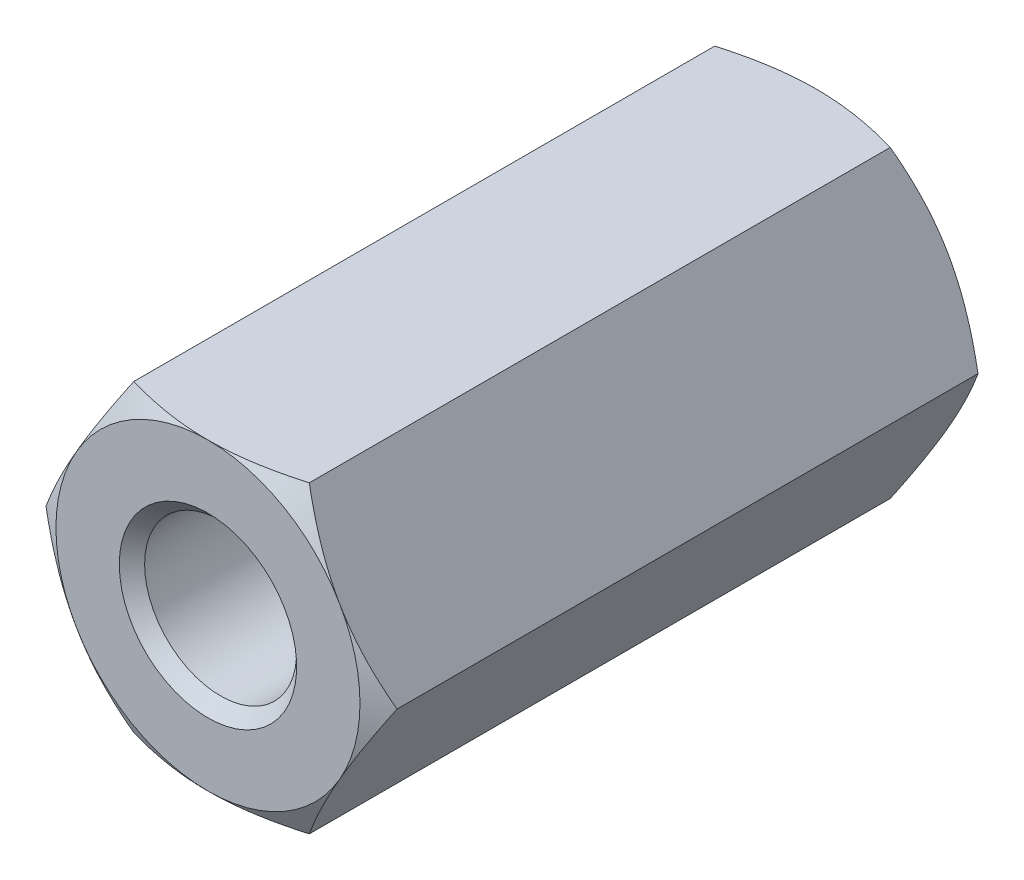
ISO-10303-21;
HEADER;
FILE_DESCRIPTION(('STEP AP214'),'2;1');
FILE_NAME('part.step','',(''),(''),'','','');
FILE_SCHEMA(('AUTOMOTIVE_DESIGN { 1 0 10303 214 1 1 1 1 }'));
ENDSEC;
DATA;
#1=APPLICATION_CONTEXT('core data for automotive mechanical design processes');
#2=APPLICATION_PROTOCOL_DEFINITION('international standard','automotive_design',2000,#1);
#3=PRODUCT_CONTEXT('',#1,'mechanical');
#4=PRODUCT('Part','Part','',(#3));
#5=PRODUCT_RELATED_PRODUCT_CATEGORY('part','',(#4));
#6=PRODUCT_DEFINITION_FORMATION('','',#4);
#7=PRODUCT_DEFINITION_CONTEXT('part definition',#1,'design');
#8=PRODUCT_DEFINITION('design','',#6,#7);
#9=PRODUCT_DEFINITION_SHAPE('','',#8);
#10=(LENGTH_UNIT() NAMED_UNIT(*) SI_UNIT(.MILLI.,.METRE.));
#11=(NAMED_UNIT(*) PLANE_ANGLE_UNIT() SI_UNIT($,.RADIAN.));
#12=(NAMED_UNIT(*) SI_UNIT($,.STERADIAN.) SOLID_ANGLE_UNIT());
#13=UNCERTAINTY_MEASURE_WITH_UNIT(LENGTH_MEASURE(1.E-05),#10,'distance_accuracy_value','');
#14=(GEOMETRIC_REPRESENTATION_CONTEXT(3) GLOBAL_UNCERTAINTY_ASSIGNED_CONTEXT((#13)) GLOBAL_UNIT_ASSIGNED_CONTEXT((#10,
#11,#12)) REPRESENTATION_CONTEXT('',''));
#15=CARTESIAN_POINT('',(0.,0.,0.));
#16=DIRECTION('',(0.,0.,1.));
#17=DIRECTION('',(1.,0.,0.));
#18=AXIS2_PLACEMENT_3D('',#15,#16,#17);
#19=CARTESIAN_POINT('',(3.46410161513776,0.,-6.));
#20=DIRECTION('',(0.866025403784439,0.5,0.));
#21=DIRECTION('',(-0.5,0.866025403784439,0.));
#22=AXIS2_PLACEMENT_3D('',#19,#20,#21);
#23=PLANE('',#22);
#24=CARTESIAN_POINT('',(3.46421708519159,-0.000199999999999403,5.73198413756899));
#25=CARTESIAN_POINT('',(3.38810199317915,0.131635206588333,5.77594629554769));
#26=CARTESIAN_POINT('',(3.31132988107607,0.26460840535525,5.81592841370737));
#27=CARTESIAN_POINT('',(3.15645624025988,0.532857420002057,5.88571791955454));
#28=CARTESIAN_POINT('',(3.078351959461,0.668138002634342,5.91550061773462));
#29=CARTESIAN_POINT('',(2.92311136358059,0.937022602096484,5.96186216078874));
#30=CARTESIAN_POINT('',(2.84599893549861,1.07058524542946,5.97874955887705));
#31=CARTESIAN_POINT('',(2.6914112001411,1.33833905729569,5.99891035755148));
#32=CARTESIAN_POINT('',(2.61393645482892,1.47252925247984,6.00220045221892));
#33=CARTESIAN_POINT('',(2.46916798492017,1.72327559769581,5.99535946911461));
#34=CARTESIAN_POINT('',(2.40185259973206,1.83986926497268,5.98690808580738));
#35=CARTESIAN_POINT('',(2.2676603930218,2.07229698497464,5.96012105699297));
#36=CARTESIAN_POINT('',(2.2007840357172,2.18813023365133,5.94177625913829));
#37=CARTESIAN_POINT('',(2.06631510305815,2.42103725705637,5.89591524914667));
#38=CARTESIAN_POINT('',(1.99873954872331,2.53808155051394,5.86820461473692));
#39=CARTESIAN_POINT('',(1.86459637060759,2.77042435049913,5.8053122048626));
#40=CARTESIAN_POINT('',(1.79802702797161,2.88572583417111,5.77014520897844));
#41=CARTESIAN_POINT('',(1.73193533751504,3.0002,5.73198413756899));
#42=B_SPLINE_CURVE_WITH_KNOTS('',3,(#24,#25,#26,#27,#28,#29,#30,#31,#32,#33,#34,#35,#36,#37,#38,
#39,#40,#41),.UNSPECIFIED.,.F.,.F.,(4,2,2,2,2,2,2,2,4),(0.,0.475539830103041,0.952222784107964,
1.41710776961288,1.88142182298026,2.28572436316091,2.69040156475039,3.10405572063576,
3.5168974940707),.UNSPECIFIED.);
#43=CARTESIAN_POINT('',(3.46410161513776,0.,5.73205080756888));
#44=VERTEX_POINT('',#43);
#45=CARTESIAN_POINT('',(2.59807621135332,1.5,6.));
#46=VERTEX_POINT('',#45);
#47=EDGE_CURVE('E127',#44,#46,#42,.T.);
#48=ORIENTED_EDGE('',*,*,#47,.F.);
#49=DIRECTION('',(0.,0.,1.));
#50=VECTOR('',#49,1.);
#51=CARTESIAN_POINT('',(3.46410161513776,0.,-6.));
#52=LINE('',#51,#50);
#53=CARTESIAN_POINT('',(3.46410161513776,0.,-5.73205080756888));
#54=VERTEX_POINT('',#53);
#55=EDGE_CURVE('E550',#54,#44,#52,.T.);
#56=ORIENTED_EDGE('',*,*,#55,.F.);
#57=CARTESIAN_POINT('',(3.46421708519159,-0.000199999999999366,-5.73198413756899));
#58=CARTESIAN_POINT('',(3.38810199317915,0.131635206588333,-5.77594629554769));
#59=CARTESIAN_POINT('',(3.31132988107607,0.26460840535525,-5.81592841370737));
#60=CARTESIAN_POINT('',(3.15645624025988,0.532857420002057,-5.88571791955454));
#61=CARTESIAN_POINT('',(3.078351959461,0.668138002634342,-5.91550061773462));
#62=CARTESIAN_POINT('',(2.92311136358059,0.937022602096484,-5.96186216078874));
#63=CARTESIAN_POINT('',(2.84599893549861,1.07058524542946,-5.97874955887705));
#64=CARTESIAN_POINT('',(2.6914112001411,1.33833905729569,-5.99891035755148));
#65=CARTESIAN_POINT('',(2.61393645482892,1.47252925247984,-6.00220045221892));
#66=CARTESIAN_POINT('',(2.46916798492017,1.72327559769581,-5.99535946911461));
#67=CARTESIAN_POINT('',(2.40185259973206,1.83986926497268,-5.98690808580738));
#68=CARTESIAN_POINT('',(2.2676603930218,2.07229698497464,-5.96012105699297));
#69=CARTESIAN_POINT('',(2.2007840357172,2.18813023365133,-5.94177625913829));
#70=CARTESIAN_POINT('',(2.06631510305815,2.42103725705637,-5.89591524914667));
#71=CARTESIAN_POINT('',(1.99873954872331,2.53808155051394,-5.86820461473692));
#72=CARTESIAN_POINT('',(1.86459637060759,2.77042435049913,-5.8053122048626));
#73=CARTESIAN_POINT('',(1.79802702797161,2.88572583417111,-5.77014520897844));
#74=CARTESIAN_POINT('',(1.73193533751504,3.0002,-5.73198413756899));
#75=B_SPLINE_CURVE_WITH_KNOTS('',3,(#57,#58,#59,#60,#61,#62,#63,#64,#65,#66,#67,#68,#69,#70,#71,
#72,#73,#74),.UNSPECIFIED.,.F.,.F.,(4,2,2,2,2,2,2,2,4),(0.,0.475539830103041,0.952222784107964,
1.41710776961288,1.88142182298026,2.28572436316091,2.69040156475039,3.10405572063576,
3.5168974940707),.UNSPECIFIED.);
#76=CARTESIAN_POINT('',(2.59807621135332,1.5,-6.));
#77=VERTEX_POINT('',#76);
#78=EDGE_CURVE('E582',#54,#77,#75,.T.);
#79=ORIENTED_EDGE('',*,*,#78,.T.);
#80=CARTESIAN_POINT('',(1.73205080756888,3.,-5.73205080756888));
#81=VERTEX_POINT('',#80);
#82=EDGE_CURVE('E269',#77,#81,#75,.T.);
#83=ORIENTED_EDGE('',*,*,#82,.T.);
#84=DIRECTION('',(0.,0.,1.));
#85=VECTOR('',#84,1.);
#86=CARTESIAN_POINT('',(1.73205080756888,3.,-6.));
#87=LINE('',#86,#85);
#88=CARTESIAN_POINT('',(1.73205080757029,3.,5.73205080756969));
#89=VERTEX_POINT('',#88);
#90=EDGE_CURVE('E159',#81,#89,#87,.T.);
#91=ORIENTED_EDGE('',*,*,#90,.T.);
#92=EDGE_CURVE('E140',#46,#89,#42,.T.);
#93=ORIENTED_EDGE('',*,*,#92,.F.);
#94=EDGE_LOOP('',(#48,#56,#79,#83,#91,#93));
#95=FACE_BOUND('',#94,.T.);
#96=ADVANCED_FACE('F41',(#95),#23,.T.);
#97=CARTESIAN_POINT('',(1.73205080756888,-3.,-6.));
#98=DIRECTION('',(0.866025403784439,-0.5,0.));
#99=DIRECTION('',(0.5,0.866025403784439,0.));
#100=AXIS2_PLACEMENT_3D('',#97,#98,#99);
#101=PLANE('',#100);
#102=CARTESIAN_POINT('',(1.73193533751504,-3.0002,5.73198413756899));
#103=CARTESIAN_POINT('',(1.80805042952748,-2.86836479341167,5.77594629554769));
#104=CARTESIAN_POINT('',(1.88482254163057,-2.73539159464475,5.81592841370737));
#105=CARTESIAN_POINT('',(2.03969618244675,-2.46714257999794,5.88571791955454));
#106=CARTESIAN_POINT('',(2.11780046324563,-2.33186199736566,5.91550061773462));
#107=CARTESIAN_POINT('',(2.27304105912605,-2.06297739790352,5.96186216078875));
#108=CARTESIAN_POINT('',(2.35015348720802,-1.92941475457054,5.97874955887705));
#109=CARTESIAN_POINT('',(2.50474122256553,-1.66166094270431,5.99891035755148));
#110=CARTESIAN_POINT('',(2.58221596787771,-1.52747074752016,6.00220045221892));
#111=CARTESIAN_POINT('',(2.72698443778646,-1.27672440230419,5.99535946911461));
#112=CARTESIAN_POINT('',(2.79429982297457,-1.16013073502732,5.98690808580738));
#113=CARTESIAN_POINT('',(2.92849202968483,-0.927703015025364,5.96012105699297));
#114=CARTESIAN_POINT('',(2.99536838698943,-0.811869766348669,5.94177625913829));
#115=CARTESIAN_POINT('',(3.12983731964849,-0.578962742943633,5.89591524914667));
#116=CARTESIAN_POINT('',(3.19741287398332,-0.461918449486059,5.86820461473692));
#117=CARTESIAN_POINT('',(3.33155605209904,-0.229575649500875,5.8053122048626));
#118=CARTESIAN_POINT('',(3.39812539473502,-0.114274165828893,5.77014520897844));
#119=CARTESIAN_POINT('',(3.46421708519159,0.000200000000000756,5.73198413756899));
#120=B_SPLINE_CURVE_WITH_KNOTS('',3,(#102,#103,#104,#105,#106,#107,#108,#109,#110,#111,#112,
#113,#114,#115,#116,#117,#118,#119),.UNSPECIFIED.,.F.,.F.,(4,2,2,2,2,2,2,2,4),(0.,
0.475539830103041,0.952222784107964,1.41710776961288,1.88142182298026,2.28572436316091,
2.69040156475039,3.10405572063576,3.5168974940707),.UNSPECIFIED.);
#121=CARTESIAN_POINT('',(1.73205080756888,-3.,5.73205080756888));
#122=VERTEX_POINT('',#121);
#123=CARTESIAN_POINT('',(2.59807621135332,-1.5,6.));
#124=VERTEX_POINT('',#123);
#125=EDGE_CURVE('E537',#122,#124,#120,.T.);
#126=ORIENTED_EDGE('',*,*,#125,.F.);
#127=DIRECTION('',(0.,0.,1.));
#128=VECTOR('',#127,1.);
#129=CARTESIAN_POINT('',(1.73205080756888,-3.,-6.));
#130=LINE('',#129,#128);
#131=CARTESIAN_POINT('',(1.73205080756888,-3.,-5.73205080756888));
#132=VERTEX_POINT('',#131);
#133=EDGE_CURVE('E283',#132,#122,#130,.T.);
#134=ORIENTED_EDGE('',*,*,#133,.F.);
#135=CARTESIAN_POINT('',(1.73193533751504,-3.0002,-5.73198413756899));
#136=CARTESIAN_POINT('',(1.80805042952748,-2.86836479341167,-5.77594629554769));
#137=CARTESIAN_POINT('',(1.88482254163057,-2.73539159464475,-5.81592841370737));
#138=CARTESIAN_POINT('',(2.03969618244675,-2.46714257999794,-5.88571791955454));
#139=CARTESIAN_POINT('',(2.11780046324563,-2.33186199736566,-5.91550061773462));
#140=CARTESIAN_POINT('',(2.27304105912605,-2.06297739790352,-5.96186216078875));
#141=CARTESIAN_POINT('',(2.35015348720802,-1.92941475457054,-5.97874955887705));
#142=CARTESIAN_POINT('',(2.50474122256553,-1.66166094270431,-5.99891035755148));
#143=CARTESIAN_POINT('',(2.58221596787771,-1.52747074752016,-6.00220045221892));
#144=CARTESIAN_POINT('',(2.72698443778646,-1.27672440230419,-5.99535946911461));
#145=CARTESIAN_POINT('',(2.79429982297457,-1.16013073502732,-5.98690808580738));
#146=CARTESIAN_POINT('',(2.92849202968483,-0.927703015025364,-5.96012105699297));
#147=CARTESIAN_POINT('',(2.99536838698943,-0.811869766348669,-5.94177625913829));
#148=CARTESIAN_POINT('',(3.12983731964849,-0.578962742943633,-5.89591524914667));
#149=CARTESIAN_POINT('',(3.19741287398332,-0.461918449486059,-5.86820461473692));
#150=CARTESIAN_POINT('',(3.33155605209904,-0.229575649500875,-5.8053122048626));
#151=CARTESIAN_POINT('',(3.39812539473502,-0.114274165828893,-5.77014520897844));
#152=CARTESIAN_POINT('',(3.46421708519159,0.000200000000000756,-5.73198413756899));
#153=B_SPLINE_CURVE_WITH_KNOTS('',3,(#135,#136,#137,#138,#139,#140,#141,#142,#143,#144,#145,
#146,#147,#148,#149,#150,#151,#152),.UNSPECIFIED.,.F.,.F.,(4,2,2,2,2,2,2,2,4),(0.,
0.475539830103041,0.952222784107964,1.41710776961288,1.88142182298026,2.28572436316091,
2.69040156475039,3.10405572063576,3.5168974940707),.UNSPECIFIED.);
#154=CARTESIAN_POINT('',(2.59807621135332,-1.5,-6.));
#155=VERTEX_POINT('',#154);
#156=EDGE_CURVE('E539',#132,#155,#153,.T.);
#157=ORIENTED_EDGE('',*,*,#156,.T.);
#158=EDGE_CURVE('E284',#155,#54,#153,.T.);
#159=ORIENTED_EDGE('',*,*,#158,.T.);
#160=ORIENTED_EDGE('',*,*,#55,.T.);
#161=EDGE_CURVE('E132',#124,#44,#120,.T.);
#162=ORIENTED_EDGE('',*,*,#161,.F.);
#163=EDGE_LOOP('',(#126,#134,#157,#159,#160,#162));
#164=FACE_BOUND('',#163,.T.);
#165=ADVANCED_FACE('F254',(#164),#101,.T.);
#166=CARTESIAN_POINT('',(-1.73205080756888,-3.,-6.));
#167=DIRECTION('',(0.,-1.,0.));
#168=DIRECTION('',(0.,0.,-1.));
#169=AXIS2_PLACEMENT_3D('',#166,#167,#168);
#170=PLANE('',#169);
#171=CARTESIAN_POINT('',(-11.3900038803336,-3.,0.93175207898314));
#172=CARTESIAN_POINT('',(-11.1402212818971,-3.,1.07120117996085));
#173=CARTESIAN_POINT('',(-10.8903172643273,-3.,1.21043343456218));
#174=CARTESIAN_POINT('',(-10.3901999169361,-3.,1.48834521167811));
#175=CARTESIAN_POINT('',(-10.1399865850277,-3.,1.62702473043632));
#176=CARTESIAN_POINT('',(-9.6391117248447,-3.,1.90375197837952));
#177=CARTESIAN_POINT('',(-9.38845008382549,-3.,2.04179950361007));
#178=CARTESIAN_POINT('',(-8.88666465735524,-3.,2.31705081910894));
#179=CARTESIAN_POINT('',(-8.6355408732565,-3.,2.45425461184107));
#180=CARTESIAN_POINT('',(-8.13250076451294,-3.,2.72770681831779));
#181=CARTESIAN_POINT('',(-7.88058395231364,-3.,2.86395433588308));
#182=CARTESIAN_POINT('',(-7.37600512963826,-3.,3.13506213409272));
#183=CARTESIAN_POINT('',(-7.12334312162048,-3.,3.26992241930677));
#184=CARTESIAN_POINT('',(-6.61708332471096,-3.,3.53778812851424));
#185=CARTESIAN_POINT('',(-6.36348567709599,-3.,3.67079381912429));
#186=CARTESIAN_POINT('',(-5.85500039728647,-3.,3.93431290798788));
#187=CARTESIAN_POINT('',(-5.60011278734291,-3.,4.06482634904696));
#188=CARTESIAN_POINT('',(-5.08914922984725,-3.,4.32207425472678));
#189=CARTESIAN_POINT('',(-4.8330772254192,-3.,4.44881653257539));
#190=CARTESIAN_POINT('',(-4.31844029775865,-3.,4.69731407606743));
#191=CARTESIAN_POINT('',(-4.05987490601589,-3.,4.8190683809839));
#192=CARTESIAN_POINT('',(-3.6688974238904,-3.,4.99621890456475));
#193=CARTESIAN_POINT('',(-3.53777997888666,-3.,5.05446851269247));
#194=CARTESIAN_POINT('',(-3.2744965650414,-3.,5.16854187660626));
#195=CARTESIAN_POINT('',(-3.14233063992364,-3.,5.22436573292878));
#196=CARTESIAN_POINT('',(-2.8767675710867,-3.,5.33295339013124));
#197=CARTESIAN_POINT('',(-2.74337064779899,-3.,5.38571772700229));
#198=CARTESIAN_POINT('',(-2.47511113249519,-3.,5.48735814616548));
#199=CARTESIAN_POINT('',(-2.34024866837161,-3.,5.536234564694));
#200=CARTESIAN_POINT('',(-2.0327436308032,-3.,5.64136869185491));
#201=CARTESIAN_POINT('',(-1.85958271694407,-3.,5.69613764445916));
#202=CARTESIAN_POINT('',(-1.510173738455,-3.,5.79491901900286));
#203=CARTESIAN_POINT('',(-1.33392584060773,-3.,5.83893202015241));
#204=CARTESIAN_POINT('',(-0.980278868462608,-3.,5.91232983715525));
#205=CARTESIAN_POINT('',(-0.802913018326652,-3.,5.94186814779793));
#206=CARTESIAN_POINT('',(-0.535401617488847,-3.,5.97335847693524));
#207=CARTESIAN_POINT('',(-0.445990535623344,-3.,5.98171899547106));
#208=CARTESIAN_POINT('',(-0.266865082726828,-3.,5.99391766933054));
#209=CARTESIAN_POINT('',(-0.177150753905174,-3.,5.99775642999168));
#210=CARTESIAN_POINT('',(0.00315277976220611,-3.,6.00078728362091));
#211=CARTESIAN_POINT('',(0.0937426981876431,-3.,5.9999379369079));
#212=CARTESIAN_POINT('',(0.274747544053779,-3.,5.99353525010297));
#213=CARTESIAN_POINT('',(0.365162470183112,-3.,5.98798187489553));
#214=CARTESIAN_POINT('',(0.635856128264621,-3.,5.96451076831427));
#215=CARTESIAN_POINT('',(0.815582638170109,-3.,5.93978204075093));
#216=CARTESIAN_POINT('',(1.08396675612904,-3.,5.89107357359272));
#217=CARTESIAN_POINT('',(1.1737345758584,-3.,5.87276348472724));
#218=CARTESIAN_POINT('',(1.35250903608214,-3.,5.83270775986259));
#219=CARTESIAN_POINT('',(1.44151566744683,-3.,5.81096208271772));
#220=CARTESIAN_POINT('',(1.61874099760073,-3.,5.76447348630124));
#221=CARTESIAN_POINT('',(1.70695964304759,-3.,5.7397303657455));
#222=CARTESIAN_POINT('',(1.88262194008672,-3.,5.6876607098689));
#223=CARTESIAN_POINT('',(1.97006563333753,-3.,5.66033431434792));
#224=CARTESIAN_POINT('',(2.23040210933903,-3.,5.57533875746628));
#225=CARTESIAN_POINT('',(2.40222853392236,-3.,5.51440131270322));
#226=CARTESIAN_POINT('',(2.74349273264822,-3.,5.38613271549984));
#227=CARTESIAN_POINT('',(2.91292981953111,-3.,5.31879976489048));
#228=CARTESIAN_POINT('',(3.25000717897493,-3.,5.17935808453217));
#229=CARTESIAN_POINT('',(3.41764556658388,-3.,5.10724482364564));
#230=CARTESIAN_POINT('',(3.75133609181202,-3.,4.95950256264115));
#231=CARTESIAN_POINT('',(3.91738839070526,-3.,4.88387392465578));
#232=CARTESIAN_POINT('',(4.24868931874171,-3.,4.72973411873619));
#233=CARTESIAN_POINT('',(4.41393458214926,-3.,4.65121574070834));
#234=CARTESIAN_POINT('',(4.74342076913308,-3.,4.49209591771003));
#235=CARTESIAN_POINT('',(4.90766167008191,-3.,4.411494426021));
#236=CARTESIAN_POINT('',(5.39899797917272,-3.,4.16735519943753));
#237=CARTESIAN_POINT('',(5.7248891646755,-3.,4.00139663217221));
#238=CARTESIAN_POINT('',(6.37494052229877,-3.,3.66514384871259));
#239=CARTESIAN_POINT('',(6.69909795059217,-3.,3.49484436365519));
#240=CARTESIAN_POINT('',(7.34595489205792,-3.,3.15140586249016));
#241=CARTESIAN_POINT('',(7.66865421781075,-3.,2.97826649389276));
#242=CARTESIAN_POINT('',(8.31253728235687,-3.,2.63023634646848));
#243=CARTESIAN_POINT('',(8.63372248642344,-3.,2.455348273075));
#244=CARTESIAN_POINT('',(9.27529852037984,-3.,2.10412078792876));
#245=CARTESIAN_POINT('',(9.5956893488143,-3.,1.92778137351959));
#246=CARTESIAN_POINT('',(10.0388880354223,-3.,1.68286313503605));
#247=CARTESIAN_POINT('',(10.1619534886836,-3.,1.61474979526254));
#248=CARTESIAN_POINT('',(10.4080246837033,-3.,1.47836422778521));
#249=CARTESIAN_POINT('',(10.5310304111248,-3.,1.41009197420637));
#250=CARTESIAN_POINT('',(10.776746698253,-3.,1.27353800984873));
#251=CARTESIAN_POINT('',(10.8994573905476,-3.,1.20525653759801));
#252=CARTESIAN_POINT('',(11.1447900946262,-3.,1.06858544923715));
#253=CARTESIAN_POINT('',(11.267412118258,-3.,1.00019585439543));
#254=CARTESIAN_POINT('',(11.3900038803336,-3.,0.931752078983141));
#255=B_SPLINE_CURVE_WITH_KNOTS('',3,(#171,#172,#173,#174,#175,#176,#177,#178,#179,#180,#181,
#182,#183,#184,#185,#186,#187,#188,#189,#190,#191,#192,#193,#194,#195,#196,#197,#198,#199,#200,
#201,#202,#203,#204,#205,#206,#207,#208,#209,#210,#211,#212,#213,#214,#215,#216,#217,#218,#219,
#220,#221,#222,#223,#224,#225,#226,#227,#228,#229,#230,#231,#232,#233,#234,#235,#236,#237,#238,
#239,#240,#241,#242,#243,#244,#245,#246,#247,#248,#249,#250,#251,#252,#253,#254),.UNSPECIFIED.,
.F.,.F.,(4,2,2,2,2,2,2,2,2,2,2,2,2,2,2,2,2,2,2,2,2,2,2,2,2,2,2,2,2,2,2,2,2,2,2,2,2,2,2,2,2,4),
(0.,0.858217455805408,1.71644073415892,2.57492380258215,3.43340436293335,4.29260376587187,
5.15180033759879,6.01087209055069,6.8699290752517,7.72706091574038,8.58435707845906,
9.01476061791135,9.44514630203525,9.87545635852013,10.3057291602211,10.8503129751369,
11.3948674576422,11.9335151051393,12.2028200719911,12.4720889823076,12.7437418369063,
13.0153967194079,13.5587097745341,13.8335126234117,14.1083187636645,14.3831433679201,
14.6579531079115,15.2046908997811,15.7515828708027,16.2990008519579,16.8463625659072,
17.3951974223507,17.9440445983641,19.041134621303,20.1396264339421,21.2382556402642,
22.3353890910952,23.4325245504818,23.854497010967,24.2765438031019,24.697830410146,
25.1190424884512),.UNSPECIFIED.);
#256=CARTESIAN_POINT('',(-1.73205080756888,-3.,5.73205080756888));
#257=VERTEX_POINT('',#256);
#258=CARTESIAN_POINT('',(0.,-3.,6.));
#259=VERTEX_POINT('',#258);
#260=EDGE_CURVE('E558',#257,#259,#255,.T.);
#261=ORIENTED_EDGE('',*,*,#260,.F.);
#262=DIRECTION('',(0.,0.,1.));
#263=VECTOR('',#262,1.);
#264=CARTESIAN_POINT('',(-1.73205080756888,-3.,-6.));
#265=LINE('',#264,#263);
#266=CARTESIAN_POINT('',(-1.73205080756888,-3.,-5.73205080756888));
#267=VERTEX_POINT('',#266);
#268=EDGE_CURVE('E535',#267,#257,#265,.T.);
#269=ORIENTED_EDGE('',*,*,#268,.F.);
#270=CARTESIAN_POINT('',(-7.74548365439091,-3.,-2.93647934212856));
#271=CARTESIAN_POINT('',(-7.57146996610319,-3.,-3.03015587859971));
#272=CARTESIAN_POINT('',(-7.3972904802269,-3.,-3.12352618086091));
#273=CARTESIAN_POINT('',(-7.0485144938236,-3.,-3.30949426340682));
#274=CARTESIAN_POINT('',(-6.87391798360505,-3.,-3.40209202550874));
#275=CARTESIAN_POINT('',(-6.52407229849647,-3.,-3.58643402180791));
#276=CARTESIAN_POINT('',(-6.34882267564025,-3.,-3.67817740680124));
#277=CARTESIAN_POINT('',(-5.99771962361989,-3.,-3.86049873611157));
#278=CARTESIAN_POINT('',(-5.82186619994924,-3.,-3.95107669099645));
#279=CARTESIAN_POINT('',(-5.46231182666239,-3.,-4.13439221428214));
#280=CARTESIAN_POINT('',(-5.27858020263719,-3.,-4.22706972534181));
#281=CARTESIAN_POINT('',(-4.91010340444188,-3.,-4.41038621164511));
#282=CARTESIAN_POINT('',(-4.72535824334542,-3.,-4.50102521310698));
#283=CARTESIAN_POINT('',(-4.35463989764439,-3.,-4.67959630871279));
#284=CARTESIAN_POINT('',(-4.16866716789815,-3.,-4.76752934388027));
#285=CARTESIAN_POINT('',(-3.79507118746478,-3.,-4.93980441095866));
#286=CARTESIAN_POINT('',(-3.60744803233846,-3.,-5.02414664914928));
#287=CARTESIAN_POINT('',(-3.21921577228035,-3.,-5.19262921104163));
#288=CARTESIAN_POINT('',(-3.0184798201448,-3.,-5.27647962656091));
#289=CARTESIAN_POINT('',(-2.61381768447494,-3.,-5.43638442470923));
#290=CARTESIAN_POINT('',(-2.40989060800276,-3.,-5.51243657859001));
#291=CARTESIAN_POINT('',(-2.00053042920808,-3.,-5.65237011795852));
#292=CARTESIAN_POINT('',(-1.79514384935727,-3.,-5.71638511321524));
#293=CARTESIAN_POINT('',(-1.38002064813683,-3.,-5.8284619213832));
#294=CARTESIAN_POINT('',(-1.17028662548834,-3.,-5.87653298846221));
#295=CARTESIAN_POINT('',(-0.794006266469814,-3.,-5.94264508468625));
#296=CARTESIAN_POINT('',(-0.628232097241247,-3.,-5.96498768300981));
#297=CARTESIAN_POINT('',(-0.295337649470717,-3.,-5.99421350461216));
#298=CARTESIAN_POINT('',(-0.128217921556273,-3.,-6.00110275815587));
#299=CARTESIAN_POINT('',(0.206103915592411,-3.,-5.99860539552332));
#300=CARTESIAN_POINT('',(0.373305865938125,-3.,-5.98919838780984));
#301=CARTESIAN_POINT('',(0.706141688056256,-3.,-5.95518699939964));
#302=CARTESIAN_POINT('',(0.871775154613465,-3.,-5.93057879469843));
#303=CARTESIAN_POINT('',(1.2182340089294,-3.,-5.86528769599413));
#304=CARTESIAN_POINT('',(1.39878062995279,-3.,-5.82316231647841));
#305=CARTESIAN_POINT('',(1.75671584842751,-3.,-5.72698316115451));
#306=CARTESIAN_POINT('',(1.93410214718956,-3.,-5.67292105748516));
#307=CARTESIAN_POINT('',(2.28638755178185,-3.,-5.55591066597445));
#308=CARTESIAN_POINT('',(2.46127894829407,-3.,-5.49293952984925));
#309=CARTESIAN_POINT('',(2.80855860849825,-3.,-5.36062387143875));
#310=CARTESIAN_POINT('',(2.98094745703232,-3.,-5.29128086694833));
#311=CARTESIAN_POINT('',(3.32628458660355,-3.,-5.14684908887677));
#312=CARTESIAN_POINT('',(3.49920347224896,-3.,-5.07169053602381));
#313=CARTESIAN_POINT('',(3.84343885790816,-3.,-4.91779095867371));
#314=CARTESIAN_POINT('',(4.01475529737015,-3.,-4.83904979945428));
#315=CARTESIAN_POINT('',(4.35585639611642,-3.,-4.67898476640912));
#316=CARTESIAN_POINT('',(4.52564298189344,-3.,-4.597664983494));
#317=CARTESIAN_POINT('',(4.86420703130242,-3.,-4.43294915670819));
#318=CARTESIAN_POINT('',(5.03298447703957,-3.,-4.34955307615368));
#319=CARTESIAN_POINT('',(5.4174896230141,-3.,-4.15725429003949));
#320=CARTESIAN_POINT('',(5.63295451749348,-3.,-4.04782684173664));
#321=CARTESIAN_POINT('',(6.06286115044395,-3.,-3.82698178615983));
#322=CARTESIAN_POINT('',(6.27730288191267,-3.,-3.71556416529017));
#323=CARTESIAN_POINT('',(6.70107258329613,-3.,-3.4934738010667));
#324=CARTESIAN_POINT('',(6.91041645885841,-3.,-3.38283135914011));
#325=CARTESIAN_POINT('',(7.32841241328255,-3.,-3.16042860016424));
#326=CARTESIAN_POINT('',(7.53706471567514,-3.,-3.04866870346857));
#327=CARTESIAN_POINT('',(7.74548365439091,-3.,-2.93647934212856));
#328=B_SPLINE_CURVE_WITH_KNOTS('',3,(#270,#271,#272,#273,#274,#275,#276,#277,#278,#279,#280,
#281,#282,#283,#284,#285,#286,#287,#288,#289,#290,#291,#292,#293,#294,#295,#296,#297,#298,#299,
#300,#301,#302,#303,#304,#305,#306,#307,#308,#309,#310,#311,#312,#313,#314,#315,#316,#317,#318,
#319,#320,#321,#322,#323,#324,#325,#326,#327),.UNSPECIFIED.,.F.,.F.,(4,2,2,2,2,2,2,2,2,2,2,2,2,
2,2,2,2,2,2,2,2,2,2,2,2,2,2,2,4),(0.,0.592879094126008,1.18577210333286,1.77920221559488,
2.37262694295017,2.98996472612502,3.6072945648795,4.22440723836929,4.8414844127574,
5.4940087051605,6.14671897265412,6.79169049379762,7.43628700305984,7.93748287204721,
8.43848312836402,8.94011073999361,9.44186459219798,9.99750279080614,10.5535298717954,
11.1110097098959,11.6683570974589,12.2339427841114,12.7995497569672,13.3643003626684,
13.9290609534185,14.6540258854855,15.3789957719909,16.0893434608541,16.7994333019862),.UNSPECIFIED.);
#329=CARTESIAN_POINT('',(0.,-3.,-6.));
#330=VERTEX_POINT('',#329);
#331=EDGE_CURVE('E547',#267,#330,#328,.T.);
#332=ORIENTED_EDGE('',*,*,#331,.T.);
#333=EDGE_CURVE('E259',#330,#132,#328,.T.);
#334=ORIENTED_EDGE('',*,*,#333,.T.);
#335=ORIENTED_EDGE('',*,*,#133,.T.);
#336=EDGE_CURVE('E138',#259,#122,#255,.T.);
#337=ORIENTED_EDGE('',*,*,#336,.F.);
#338=EDGE_LOOP('',(#261,#269,#332,#334,#335,#337));
#339=FACE_BOUND('',#338,.T.);
#340=ADVANCED_FACE('F292',(#339),#170,.T.);
#341=CARTESIAN_POINT('',(-3.46410161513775,0.,-6.));
#342=DIRECTION('',(-0.866025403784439,-0.5,0.));
#343=DIRECTION('',(0.5,-0.866025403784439,0.));
#344=AXIS2_PLACEMENT_3D('',#341,#342,#343);
#345=PLANE('',#344);
#346=CARTESIAN_POINT('',(-3.46421708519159,0.000200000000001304,5.73198413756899));
#347=CARTESIAN_POINT('',(-3.38810199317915,-0.131635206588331,5.77594629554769));
#348=CARTESIAN_POINT('',(-3.31132988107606,-0.264608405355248,5.81592841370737));
#349=CARTESIAN_POINT('',(-3.15645624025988,-0.532857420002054,5.88571791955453));
#350=CARTESIAN_POINT('',(-3.078351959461,-0.66813800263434,5.91550061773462));
#351=CARTESIAN_POINT('',(-2.92311136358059,-0.937022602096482,5.96186216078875));
#352=CARTESIAN_POINT('',(-2.84599893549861,-1.07058524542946,5.97874955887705));
#353=CARTESIAN_POINT('',(-2.6914112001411,-1.33833905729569,5.99891035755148));
#354=CARTESIAN_POINT('',(-2.61393645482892,-1.47252925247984,6.00220045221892));
#355=CARTESIAN_POINT('',(-2.46916798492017,-1.72327559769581,5.99535946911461));
#356=CARTESIAN_POINT('',(-2.40185259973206,-1.83986926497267,5.98690808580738));
#357=CARTESIAN_POINT('',(-2.2676603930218,-2.07229698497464,5.96012105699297));
#358=CARTESIAN_POINT('',(-2.2007840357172,-2.18813023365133,5.94177625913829));
#359=CARTESIAN_POINT('',(-2.06631510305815,-2.42103725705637,5.89591524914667));
#360=CARTESIAN_POINT('',(-1.99873954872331,-2.53808155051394,5.86820461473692));
#361=CARTESIAN_POINT('',(-1.86459637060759,-2.77042435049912,5.8053122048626));
#362=CARTESIAN_POINT('',(-1.79802702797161,-2.88572583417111,5.77014520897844));
#363=CARTESIAN_POINT('',(-1.73193533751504,-3.0002,5.73198413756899));
#364=B_SPLINE_CURVE_WITH_KNOTS('',3,(#346,#347,#348,#349,#350,#351,#352,#353,#354,#355,#356,
#357,#358,#359,#360,#361,#362,#363),.UNSPECIFIED.,.F.,.F.,(4,2,2,2,2,2,2,2,4),(0.,
0.47553983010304,0.952222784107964,1.41710776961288,1.88142182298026,2.28572436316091,
2.69040156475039,3.10405572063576,3.5168974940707),.UNSPECIFIED.);
#365=CARTESIAN_POINT('',(-3.46410161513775,0.,5.73205080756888));
#366=VERTEX_POINT('',#365);
#367=CARTESIAN_POINT('',(-2.59807621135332,-1.5,6.));
#368=VERTEX_POINT('',#367);
#369=EDGE_CURVE('E176',#366,#368,#364,.T.);
#370=ORIENTED_EDGE('',*,*,#369,.F.);
#371=DIRECTION('',(0.,0.,1.));
#372=VECTOR('',#371,1.);
#373=CARTESIAN_POINT('',(-3.46410161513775,0.,-6.));
#374=LINE('',#373,#372);
#375=CARTESIAN_POINT('',(-3.46410161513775,0.,-5.73205080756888));
#376=VERTEX_POINT('',#375);
#377=EDGE_CURVE('E546',#376,#366,#374,.T.);
#378=ORIENTED_EDGE('',*,*,#377,.F.);
#379=CARTESIAN_POINT('',(-3.46421708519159,0.000200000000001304,-5.73198413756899));
#380=CARTESIAN_POINT('',(-3.38810199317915,-0.131635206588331,-5.77594629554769));
#381=CARTESIAN_POINT('',(-3.31132988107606,-0.264608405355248,-5.81592841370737));
#382=CARTESIAN_POINT('',(-3.15645624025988,-0.532857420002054,-5.88571791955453));
#383=CARTESIAN_POINT('',(-3.078351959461,-0.66813800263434,-5.91550061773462));
#384=CARTESIAN_POINT('',(-2.92311136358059,-0.937022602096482,-5.96186216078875));
#385=CARTESIAN_POINT('',(-2.84599893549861,-1.07058524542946,-5.97874955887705));
#386=CARTESIAN_POINT('',(-2.6914112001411,-1.33833905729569,-5.99891035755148));
#387=CARTESIAN_POINT('',(-2.61393645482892,-1.47252925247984,-6.00220045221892));
#388=CARTESIAN_POINT('',(-2.46916798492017,-1.72327559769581,-5.99535946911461));
#389=CARTESIAN_POINT('',(-2.40185259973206,-1.83986926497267,-5.98690808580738));
#390=CARTESIAN_POINT('',(-2.2676603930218,-2.07229698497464,-5.96012105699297));
#391=CARTESIAN_POINT('',(-2.2007840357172,-2.18813023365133,-5.94177625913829));
#392=CARTESIAN_POINT('',(-2.06631510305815,-2.42103725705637,-5.89591524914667));
#393=CARTESIAN_POINT('',(-1.99873954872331,-2.53808155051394,-5.86820461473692));
#394=CARTESIAN_POINT('',(-1.86459637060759,-2.77042435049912,-5.8053122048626));
#395=CARTESIAN_POINT('',(-1.79802702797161,-2.88572583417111,-5.77014520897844));
#396=CARTESIAN_POINT('',(-1.73193533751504,-3.0002,-5.73198413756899));
#397=B_SPLINE_CURVE_WITH_KNOTS('',3,(#379,#380,#381,#382,#383,#384,#385,#386,#387,#388,#389,
#390,#391,#392,#393,#394,#395,#396),.UNSPECIFIED.,.F.,.F.,(4,2,2,2,2,2,2,2,4),(0.,
0.47553983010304,0.952222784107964,1.41710776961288,1.88142182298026,2.28572436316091,
2.69040156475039,3.10405572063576,3.5168974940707),.UNSPECIFIED.);
#398=CARTESIAN_POINT('',(-2.59807621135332,-1.5,-6.));
#399=VERTEX_POINT('',#398);
#400=EDGE_CURVE('E275',#376,#399,#397,.T.);
#401=ORIENTED_EDGE('',*,*,#400,.T.);
#402=EDGE_CURVE('E282',#399,#267,#397,.T.);
#403=ORIENTED_EDGE('',*,*,#402,.T.);
#404=ORIENTED_EDGE('',*,*,#268,.T.);
#405=EDGE_CURVE('E543',#368,#257,#364,.T.);
#406=ORIENTED_EDGE('',*,*,#405,.F.);
#407=EDGE_LOOP('',(#370,#378,#401,#403,#404,#406));
#408=FACE_BOUND('',#407,.T.);
#409=ADVANCED_FACE('F289',(#408),#345,.T.);
#410=CARTESIAN_POINT('',(-1.73205080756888,3.,-6.));
#411=DIRECTION('',(-0.866025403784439,0.5,0.));
#412=DIRECTION('',(-0.5,-0.866025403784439,0.));
#413=AXIS2_PLACEMENT_3D('',#410,#411,#412);
#414=PLANE('',#413);
#415=CARTESIAN_POINT('',(-1.73193533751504,3.0002,5.73198413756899));
#416=CARTESIAN_POINT('',(-1.80805042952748,2.86836479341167,5.77594629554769));
#417=CARTESIAN_POINT('',(-1.88482254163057,2.73539159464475,5.81592841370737));
#418=CARTESIAN_POINT('',(-2.03969618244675,2.46714257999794,5.88571791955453));
#419=CARTESIAN_POINT('',(-2.11780046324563,2.33186199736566,5.91550061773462));
#420=CARTESIAN_POINT('',(-2.27304105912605,2.06297739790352,5.96186216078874));
#421=CARTESIAN_POINT('',(-2.35015348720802,1.92941475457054,5.97874955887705));
#422=CARTESIAN_POINT('',(-2.50474122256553,1.66166094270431,5.99891035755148));
#423=CARTESIAN_POINT('',(-2.58221596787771,1.52747074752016,6.00220045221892));
#424=CARTESIAN_POINT('',(-2.72698443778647,1.27672440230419,5.99535946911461));
#425=CARTESIAN_POINT('',(-2.79429982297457,1.16013073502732,5.98690808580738));
#426=CARTESIAN_POINT('',(-2.92849202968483,0.927703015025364,5.96012105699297));
#427=CARTESIAN_POINT('',(-2.99536838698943,0.81186976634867,5.94177625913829));
#428=CARTESIAN_POINT('',(-3.12983731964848,0.578962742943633,5.89591524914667));
#429=CARTESIAN_POINT('',(-3.19741287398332,0.46191844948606,5.86820461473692));
#430=CARTESIAN_POINT('',(-3.33155605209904,0.229575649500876,5.8053122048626));
#431=CARTESIAN_POINT('',(-3.39812539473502,0.114274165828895,5.77014520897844));
#432=CARTESIAN_POINT('',(-3.46421708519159,-0.000199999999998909,5.73198413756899));
#433=B_SPLINE_CURVE_WITH_KNOTS('',3,(#415,#416,#417,#418,#419,#420,#421,#422,#423,#424,#425,
#426,#427,#428,#429,#430,#431,#432),.UNSPECIFIED.,.F.,.F.,(4,2,2,2,2,2,2,2,4),(0.,
0.475539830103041,0.952222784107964,1.41710776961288,1.88142182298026,2.28572436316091,
2.69040156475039,3.10405572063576,3.5168974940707),.UNSPECIFIED.);
#434=CARTESIAN_POINT('',(-1.73205080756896,3.,5.73205080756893));
#435=VERTEX_POINT('',#434);
#436=CARTESIAN_POINT('',(-2.59807621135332,1.5,6.));
#437=VERTEX_POINT('',#436);
#438=EDGE_CURVE('E183',#435,#437,#433,.T.);
#439=ORIENTED_EDGE('',*,*,#438,.F.);
#440=DIRECTION('',(0.,0.,1.));
#441=VECTOR('',#440,1.);
#442=CARTESIAN_POINT('',(-1.73205080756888,3.,-6.));
#443=LINE('',#442,#441);
#444=CARTESIAN_POINT('',(-1.73205080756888,3.,-5.73205080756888));
#445=VERTEX_POINT('',#444);
#446=EDGE_CURVE('E233',#445,#435,#443,.T.);
#447=ORIENTED_EDGE('',*,*,#446,.F.);
#448=CARTESIAN_POINT('',(-1.73193533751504,3.0002,-5.73198413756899));
#449=CARTESIAN_POINT('',(-1.80805042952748,2.86836479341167,-5.77594629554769));
#450=CARTESIAN_POINT('',(-1.88482254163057,2.73539159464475,-5.81592841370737));
#451=CARTESIAN_POINT('',(-2.03969618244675,2.46714257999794,-5.88571791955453));
#452=CARTESIAN_POINT('',(-2.11780046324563,2.33186199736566,-5.91550061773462));
#453=CARTESIAN_POINT('',(-2.27304105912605,2.06297739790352,-5.96186216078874));
#454=CARTESIAN_POINT('',(-2.35015348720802,1.92941475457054,-5.97874955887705));
#455=CARTESIAN_POINT('',(-2.50474122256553,1.66166094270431,-5.99891035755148));
#456=CARTESIAN_POINT('',(-2.58221596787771,1.52747074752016,-6.00220045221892));
#457=CARTESIAN_POINT('',(-2.72698443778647,1.27672440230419,-5.99535946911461));
#458=CARTESIAN_POINT('',(-2.79429982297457,1.16013073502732,-5.98690808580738));
#459=CARTESIAN_POINT('',(-2.92849202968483,0.927703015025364,-5.96012105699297));
#460=CARTESIAN_POINT('',(-2.99536838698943,0.81186976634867,-5.94177625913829));
#461=CARTESIAN_POINT('',(-3.12983731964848,0.578962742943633,-5.89591524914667));
#462=CARTESIAN_POINT('',(-3.19741287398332,0.46191844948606,-5.86820461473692));
#463=CARTESIAN_POINT('',(-3.33155605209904,0.229575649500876,-5.8053122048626));
#464=CARTESIAN_POINT('',(-3.39812539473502,0.114274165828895,-5.77014520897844));
#465=CARTESIAN_POINT('',(-3.46421708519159,-0.000199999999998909,-5.73198413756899));
#466=B_SPLINE_CURVE_WITH_KNOTS('',3,(#448,#449,#450,#451,#452,#453,#454,#455,#456,#457,#458,
#459,#460,#461,#462,#463,#464,#465),.UNSPECIFIED.,.F.,.F.,(4,2,2,2,2,2,2,2,4),(0.,
0.475539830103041,0.952222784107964,1.41710776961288,1.88142182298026,2.28572436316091,
2.69040156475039,3.10405572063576,3.5168974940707),.UNSPECIFIED.);
#467=CARTESIAN_POINT('',(-2.59807621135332,1.5,-6.));
#468=VERTEX_POINT('',#467);
#469=EDGE_CURVE('E237',#445,#468,#466,.T.);
#470=ORIENTED_EDGE('',*,*,#469,.T.);
#471=EDGE_CURVE('E534',#468,#376,#466,.T.);
#472=ORIENTED_EDGE('',*,*,#471,.T.);
#473=ORIENTED_EDGE('',*,*,#377,.T.);
#474=EDGE_CURVE('E562',#437,#366,#433,.T.);
#475=ORIENTED_EDGE('',*,*,#474,.F.);
#476=EDGE_LOOP('',(#439,#447,#470,#472,#473,#475));
#477=FACE_BOUND('',#476,.T.);
#478=ADVANCED_FACE('F218',(#477),#414,.T.);
#479=CARTESIAN_POINT('',(1.73205080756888,3.,-6.));
#480=DIRECTION('',(0.,1.,0.));
#481=DIRECTION('',(-1.,0.,0.));
#482=AXIS2_PLACEMENT_3D('',#479,#480,#481);
#483=PLANE('',#482);
#484=CARTESIAN_POINT('',(11.3900038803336,3.,0.93175207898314));
#485=CARTESIAN_POINT('',(11.1402212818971,3.,1.07120117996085));
#486=CARTESIAN_POINT('',(10.8903172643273,3.,1.21043343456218));
#487=CARTESIAN_POINT('',(10.3901999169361,3.,1.48834521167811));
#488=CARTESIAN_POINT('',(10.1399865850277,3.,1.62702473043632));
#489=CARTESIAN_POINT('',(9.6391117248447,3.,1.90375197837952));
#490=CARTESIAN_POINT('',(9.38845008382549,3.,2.04179950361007));
#491=CARTESIAN_POINT('',(8.88666465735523,3.,2.31705081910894));
#492=CARTESIAN_POINT('',(8.6355408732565,3.,2.45425461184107));
#493=CARTESIAN_POINT('',(8.13250076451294,3.,2.72770681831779));
#494=CARTESIAN_POINT('',(7.88058395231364,3.,2.86395433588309));
#495=CARTESIAN_POINT('',(7.37600512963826,3.,3.13506213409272));
#496=CARTESIAN_POINT('',(7.12334312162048,3.,3.26992241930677));
#497=CARTESIAN_POINT('',(6.61708332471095,3.,3.53778812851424));
#498=CARTESIAN_POINT('',(6.36348567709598,3.,3.67079381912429));
#499=CARTESIAN_POINT('',(5.85500039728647,3.,3.93431290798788));
#500=CARTESIAN_POINT('',(5.60011278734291,3.,4.06482634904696));
#501=CARTESIAN_POINT('',(5.08914922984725,3.,4.32207425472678));
#502=CARTESIAN_POINT('',(4.83307722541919,3.,4.44881653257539));
#503=CARTESIAN_POINT('',(4.31844029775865,3.,4.69731407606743));
#504=CARTESIAN_POINT('',(4.05987490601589,3.,4.8190683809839));
#505=CARTESIAN_POINT('',(3.6688974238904,3.,4.99621890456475));
#506=CARTESIAN_POINT('',(3.53777997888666,3.,5.05446851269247));
#507=CARTESIAN_POINT('',(3.2744965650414,3.,5.16854187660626));
#508=CARTESIAN_POINT('',(3.14233063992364,3.,5.22436573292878));
#509=CARTESIAN_POINT('',(2.87676757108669,3.,5.33295339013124));
#510=CARTESIAN_POINT('',(2.74337064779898,3.,5.38571772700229));
#511=CARTESIAN_POINT('',(2.47511113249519,3.,5.48735814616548));
#512=CARTESIAN_POINT('',(2.34024866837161,3.,5.536234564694));
#513=CARTESIAN_POINT('',(2.03274363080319,3.,5.64136869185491));
#514=CARTESIAN_POINT('',(1.85958271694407,3.,5.69613764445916));
#515=CARTESIAN_POINT('',(1.510173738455,3.,5.79491901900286));
#516=CARTESIAN_POINT('',(1.33392584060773,3.,5.83893202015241));
#517=CARTESIAN_POINT('',(0.980278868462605,3.,5.91232983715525));
#518=CARTESIAN_POINT('',(0.802913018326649,3.,5.94186814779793));
#519=CARTESIAN_POINT('',(0.535401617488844,3.,5.97335847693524));
#520=CARTESIAN_POINT('',(0.445990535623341,3.,5.98171899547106));
#521=CARTESIAN_POINT('',(0.266865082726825,3.,5.99391766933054));
#522=CARTESIAN_POINT('',(0.177150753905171,3.,5.99775642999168));
#523=CARTESIAN_POINT('',(-0.0031527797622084,3.,6.0007872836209));
#524=CARTESIAN_POINT('',(-0.0937426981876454,3.,5.9999379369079));
#525=CARTESIAN_POINT('',(-0.274747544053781,3.,5.99353525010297));
#526=CARTESIAN_POINT('',(-0.365162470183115,3.,5.98798187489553));
#527=CARTESIAN_POINT('',(-0.635856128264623,3.,5.96451076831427));
#528=CARTESIAN_POINT('',(-0.815582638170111,3.,5.93978204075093));
#529=CARTESIAN_POINT('',(-1.08396675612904,3.,5.89107357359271));
#530=CARTESIAN_POINT('',(-1.1737345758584,3.,5.87276348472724));
#531=CARTESIAN_POINT('',(-1.35250903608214,3.,5.83270775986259));
#532=CARTESIAN_POINT('',(-1.44151566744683,3.,5.81096208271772));
#533=CARTESIAN_POINT('',(-1.61874099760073,3.,5.76447348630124));
#534=CARTESIAN_POINT('',(-1.70695964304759,3.,5.7397303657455));
#535=CARTESIAN_POINT('',(-1.88262194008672,3.,5.6876607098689));
#536=CARTESIAN_POINT('',(-1.97006563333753,3.,5.66033431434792));
#537=CARTESIAN_POINT('',(-2.23040210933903,3.,5.57533875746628));
#538=CARTESIAN_POINT('',(-2.40222853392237,3.,5.51440131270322));
#539=CARTESIAN_POINT('',(-2.74349273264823,3.,5.38613271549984));
#540=CARTESIAN_POINT('',(-2.91292981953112,3.,5.31879976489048));
#541=CARTESIAN_POINT('',(-3.25000717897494,3.,5.17935808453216));
#542=CARTESIAN_POINT('',(-3.41764556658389,3.,5.10724482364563));
#543=CARTESIAN_POINT('',(-3.75133609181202,3.,4.95950256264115));
#544=CARTESIAN_POINT('',(-3.91738839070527,3.,4.88387392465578));
#545=CARTESIAN_POINT('',(-4.24868931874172,3.,4.72973411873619));
#546=CARTESIAN_POINT('',(-4.41393458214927,3.,4.65121574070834));
#547=CARTESIAN_POINT('',(-4.74342076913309,3.,4.49209591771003));
#548=CARTESIAN_POINT('',(-4.90766167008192,3.,4.411494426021));
#549=CARTESIAN_POINT('',(-5.39899797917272,3.,4.16735519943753));
#550=CARTESIAN_POINT('',(-5.72488916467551,3.,4.00139663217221));
#551=CARTESIAN_POINT('',(-6.37494052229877,3.,3.66514384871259));
#552=CARTESIAN_POINT('',(-6.69909795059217,3.,3.49484436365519));
#553=CARTESIAN_POINT('',(-7.34595489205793,3.,3.15140586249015));
#554=CARTESIAN_POINT('',(-7.66865421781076,3.,2.97826649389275));
#555=CARTESIAN_POINT('',(-8.31253728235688,3.,2.63023634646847));
#556=CARTESIAN_POINT('',(-8.63372248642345,3.,2.455348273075));
#557=CARTESIAN_POINT('',(-9.27529852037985,3.,2.10412078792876));
#558=CARTESIAN_POINT('',(-9.59568934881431,3.,1.92778137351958));
#559=CARTESIAN_POINT('',(-10.0388880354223,3.,1.68286313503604));
#560=CARTESIAN_POINT('',(-10.1619534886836,3.,1.61474979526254));
#561=CARTESIAN_POINT('',(-10.4080246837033,3.,1.4783642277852));
#562=CARTESIAN_POINT('',(-10.5310304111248,3.,1.41009197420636));
#563=CARTESIAN_POINT('',(-10.776746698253,3.,1.27353800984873));
#564=CARTESIAN_POINT('',(-10.8994573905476,3.,1.205256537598));
#565=CARTESIAN_POINT('',(-11.1447900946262,3.,1.06858544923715));
#566=CARTESIAN_POINT('',(-11.267412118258,3.,1.00019585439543));
#567=CARTESIAN_POINT('',(-11.3900038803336,3.,0.931752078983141));
#568=B_SPLINE_CURVE_WITH_KNOTS('',3,(#484,#485,#486,#487,#488,#489,#490,#491,#492,#493,#494,
#495,#496,#497,#498,#499,#500,#501,#502,#503,#504,#505,#506,#507,#508,#509,#510,#511,#512,#513,
#514,#515,#516,#517,#518,#519,#520,#521,#522,#523,#524,#525,#526,#527,#528,#529,#530,#531,#532,
#533,#534,#535,#536,#537,#538,#539,#540,#541,#542,#543,#544,#545,#546,#547,#548,#549,#550,#551,
#552,#553,#554,#555,#556,#557,#558,#559,#560,#561,#562,#563,#564,#565,#566,#567),.UNSPECIFIED.,
.F.,.F.,(4,2,2,2,2,2,2,2,2,2,2,2,2,2,2,2,2,2,2,2,2,2,2,2,2,2,2,2,2,2,2,2,2,2,2,2,2,2,2,2,2,4),
(0.,0.858217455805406,1.71644073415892,2.57492380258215,3.43340436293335,4.29260376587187,
5.15180033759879,6.01087209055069,6.8699290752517,7.72706091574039,8.58435707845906,
9.01476061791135,9.44514630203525,9.87545635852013,10.3057291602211,10.8503129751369,
11.3948674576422,11.9335151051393,12.2028200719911,12.4720889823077,12.7437418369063,
13.0153967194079,13.5587097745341,13.8335126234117,14.1083187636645,14.3831433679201,
14.6579531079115,15.2046908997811,15.7515828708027,16.2990008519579,16.8463625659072,
17.3951974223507,17.9440445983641,19.041134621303,20.1396264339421,21.2382556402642,
22.3353890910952,23.4325245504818,23.854497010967,24.276543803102,24.697830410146,
25.1190424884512),.UNSPECIFIED.);
#569=CARTESIAN_POINT('',(0.,3.,6.));
#570=VERTEX_POINT('',#569);
#571=EDGE_CURVE('E145',#89,#570,#568,.T.);
#572=ORIENTED_EDGE('',*,*,#571,.F.);
#573=ORIENTED_EDGE('',*,*,#90,.F.);
#574=CARTESIAN_POINT('',(7.7454836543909,3.,-2.93647934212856));
#575=CARTESIAN_POINT('',(7.57146996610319,3.,-3.03015587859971));
#576=CARTESIAN_POINT('',(7.3972904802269,3.,-3.12352618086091));
#577=CARTESIAN_POINT('',(7.0485144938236,3.,-3.30949426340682));
#578=CARTESIAN_POINT('',(6.87391798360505,3.,-3.40209202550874));
#579=CARTESIAN_POINT('',(6.52407229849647,3.,-3.58643402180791));
#580=CARTESIAN_POINT('',(6.34882267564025,3.,-3.67817740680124));
#581=CARTESIAN_POINT('',(5.99771962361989,3.,-3.86049873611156));
#582=CARTESIAN_POINT('',(5.82186619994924,3.,-3.95107669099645));
#583=CARTESIAN_POINT('',(5.46231182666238,3.,-4.13439221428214));
#584=CARTESIAN_POINT('',(5.27858020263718,3.,-4.22706972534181));
#585=CARTESIAN_POINT('',(4.91010340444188,3.,-4.41038621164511));
#586=CARTESIAN_POINT('',(4.72535824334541,3.,-4.50102521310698));
#587=CARTESIAN_POINT('',(4.35463989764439,3.,-4.67959630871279));
#588=CARTESIAN_POINT('',(4.16866716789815,3.,-4.76752934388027));
#589=CARTESIAN_POINT('',(3.79507118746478,3.,-4.93980441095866));
#590=CARTESIAN_POINT('',(3.60744803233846,3.,-5.02414664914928));
#591=CARTESIAN_POINT('',(3.21921577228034,3.,-5.19262921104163));
#592=CARTESIAN_POINT('',(3.01847982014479,3.,-5.27647962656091));
#593=CARTESIAN_POINT('',(2.61381768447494,3.,-5.43638442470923));
#594=CARTESIAN_POINT('',(2.40989060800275,3.,-5.51243657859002));
#595=CARTESIAN_POINT('',(2.00053042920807,3.,-5.65237011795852));
#596=CARTESIAN_POINT('',(1.79514384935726,3.,-5.71638511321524));
#597=CARTESIAN_POINT('',(1.38002064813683,3.,-5.8284619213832));
#598=CARTESIAN_POINT('',(1.17028662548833,3.,-5.87653298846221));
#599=CARTESIAN_POINT('',(0.79400626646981,3.,-5.94264508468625));
#600=CARTESIAN_POINT('',(0.628232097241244,3.,-5.96498768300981));
#601=CARTESIAN_POINT('',(0.295337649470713,3.,-5.99421350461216));
#602=CARTESIAN_POINT('',(0.128217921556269,3.,-6.00110275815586));
#603=CARTESIAN_POINT('',(-0.206103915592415,3.,-5.99860539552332));
#604=CARTESIAN_POINT('',(-0.373305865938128,3.,-5.98919838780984));
#605=CARTESIAN_POINT('',(-0.706141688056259,3.,-5.95518699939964));
#606=CARTESIAN_POINT('',(-0.871775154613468,3.,-5.93057879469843));
#607=CARTESIAN_POINT('',(-1.21823400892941,3.,-5.86528769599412));
#608=CARTESIAN_POINT('',(-1.39878062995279,3.,-5.82316231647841));
#609=CARTESIAN_POINT('',(-1.75671584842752,3.,-5.72698316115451));
#610=CARTESIAN_POINT('',(-1.93410214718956,3.,-5.67292105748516));
#611=CARTESIAN_POINT('',(-2.28638755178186,3.,-5.55591066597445));
#612=CARTESIAN_POINT('',(-2.46127894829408,3.,-5.49293952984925));
#613=CARTESIAN_POINT('',(-2.80855860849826,3.,-5.36062387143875));
#614=CARTESIAN_POINT('',(-2.98094745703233,3.,-5.29128086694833));
#615=CARTESIAN_POINT('',(-3.32628458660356,3.,-5.14684908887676));
#616=CARTESIAN_POINT('',(-3.49920347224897,3.,-5.0716905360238));
#617=CARTESIAN_POINT('',(-3.84343885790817,3.,-4.91779095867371));
#618=CARTESIAN_POINT('',(-4.01475529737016,3.,-4.83904979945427));
#619=CARTESIAN_POINT('',(-4.35585639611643,3.,-4.67898476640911));
#620=CARTESIAN_POINT('',(-4.52564298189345,3.,-4.597664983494));
#621=CARTESIAN_POINT('',(-4.86420703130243,3.,-4.43294915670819));
#622=CARTESIAN_POINT('',(-5.03298447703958,3.,-4.34955307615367));
#623=CARTESIAN_POINT('',(-5.41748962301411,3.,-4.15725429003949));
#624=CARTESIAN_POINT('',(-5.63295451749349,3.,-4.04782684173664));
#625=CARTESIAN_POINT('',(-6.06286115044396,3.,-3.82698178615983));
#626=CARTESIAN_POINT('',(-6.27730288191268,3.,-3.71556416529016));
#627=CARTESIAN_POINT('',(-6.70107258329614,3.,-3.4934738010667));
#628=CARTESIAN_POINT('',(-6.91041645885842,3.,-3.3828313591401));
#629=CARTESIAN_POINT('',(-7.32841241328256,3.,-3.16042860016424));
#630=CARTESIAN_POINT('',(-7.53706471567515,3.,-3.04866870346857));
#631=CARTESIAN_POINT('',(-7.74548365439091,3.,-2.93647934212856));
#632=B_SPLINE_CURVE_WITH_KNOTS('',3,(#574,#575,#576,#577,#578,#579,#580,#581,#582,#583,#584,
#585,#586,#587,#588,#589,#590,#591,#592,#593,#594,#595,#596,#597,#598,#599,#600,#601,#602,#603,
#604,#605,#606,#607,#608,#609,#610,#611,#612,#613,#614,#615,#616,#617,#618,#619,#620,#621,#622,
#623,#624,#625,#626,#627,#628,#629,#630,#631),.UNSPECIFIED.,.F.,.F.,(4,2,2,2,2,2,2,2,2,2,2,2,2,
2,2,2,2,2,2,2,2,2,2,2,2,2,2,2,4),(0.,0.592879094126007,1.18577210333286,1.77920221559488,
2.37262694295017,2.98996472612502,3.60729456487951,4.2244072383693,4.8414844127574,
5.49400870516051,6.14671897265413,6.79169049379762,7.43628700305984,7.93748287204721,
8.43848312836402,8.94011073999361,9.44186459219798,9.99750279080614,10.5535298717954,
11.1110097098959,11.6683570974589,12.2339427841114,12.7995497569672,13.3643003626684,
13.9290609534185,14.6540258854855,15.3789957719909,16.0893434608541,16.7994333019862),.UNSPECIFIED.);
#633=CARTESIAN_POINT('',(0.,3.,-6.));
#634=VERTEX_POINT('',#633);
#635=EDGE_CURVE('E234',#81,#634,#632,.T.);
#636=ORIENTED_EDGE('',*,*,#635,.T.);
#637=EDGE_CURVE('E223',#634,#445,#632,.T.);
#638=ORIENTED_EDGE('',*,*,#637,.T.);
#639=ORIENTED_EDGE('',*,*,#446,.T.);
#640=EDGE_CURVE('E161',#570,#435,#568,.T.);
#641=ORIENTED_EDGE('',*,*,#640,.F.);
#642=EDGE_LOOP('',(#572,#573,#636,#638,#639,#641));
#643=FACE_BOUND('',#642,.T.);
#644=ADVANCED_FACE('F214',(#643),#483,.T.);
#645=CARTESIAN_POINT('',(0.,0.,-6.));
#646=DIRECTION('',(0.,0.,1.));
#647=DIRECTION('',(-1.,0.,0.));
#648=AXIS2_PLACEMENT_3D('',#645,#646,#647);
#649=CONICAL_SURFACE('',#648,3.,1.0471975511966);
#650=CARTESIAN_POINT('',(0.,0.,-6.));
#651=DIRECTION('',(0.,0.,1.));
#652=DIRECTION('',(1.,0.,0.));
#653=AXIS2_PLACEMENT_3D('',#650,#651,#652);
#654=CIRCLE('',#653,3.);
#655=EDGE_CURVE('E531',#155,#77,#654,.T.);
#656=ORIENTED_EDGE('',*,*,#655,.T.);
#657=ORIENTED_EDGE('',*,*,#78,.F.);
#658=ORIENTED_EDGE('',*,*,#158,.F.);
#659=EDGE_LOOP('',(#656,#657,#658));
#660=FACE_BOUND('',#659,.T.);
#661=ADVANCED_FACE('F217',(#660),#649,.T.);
#662=EDGE_CURVE('E555',#330,#155,#654,.T.);
#663=ORIENTED_EDGE('',*,*,#662,.T.);
#664=ORIENTED_EDGE('',*,*,#156,.F.);
#665=ORIENTED_EDGE('',*,*,#333,.F.);
#666=EDGE_LOOP('',(#663,#664,#665));
#667=FACE_BOUND('',#666,.T.);
#668=ADVANCED_FACE('F337',(#667),#649,.T.);
#669=ORIENTED_EDGE('',*,*,#402,.F.);
#670=EDGE_CURVE('E557',#399,#330,#654,.T.);
#671=ORIENTED_EDGE('',*,*,#670,.T.);
#672=ORIENTED_EDGE('',*,*,#331,.F.);
#673=EDGE_LOOP('',(#669,#671,#672));
#674=FACE_BOUND('',#673,.T.);
#675=ADVANCED_FACE('F251',(#674),#649,.T.);
#676=ORIENTED_EDGE('',*,*,#471,.F.);
#677=EDGE_CURVE('E530',#468,#399,#654,.T.);
#678=ORIENTED_EDGE('',*,*,#677,.T.);
#679=ORIENTED_EDGE('',*,*,#400,.F.);
#680=EDGE_LOOP('',(#676,#678,#679));
#681=FACE_BOUND('',#680,.T.);
#682=ADVANCED_FACE('F249',(#681),#649,.T.);
#683=ORIENTED_EDGE('',*,*,#637,.F.);
#684=CARTESIAN_POINT('',(0.,0.,-6.));
#685=DIRECTION('',(0.,0.,-1.));
#686=DIRECTION('',(-1.,0.,0.));
#687=AXIS2_PLACEMENT_3D('',#684,#685,#686);
#688=CIRCLE('',#687,3.);
#689=EDGE_CURVE('E235',#468,#634,#688,.T.);
#690=ORIENTED_EDGE('',*,*,#689,.F.);
#691=ORIENTED_EDGE('',*,*,#469,.F.);
#692=EDGE_LOOP('',(#683,#690,#691));
#693=FACE_BOUND('',#692,.T.);
#694=ADVANCED_FACE('F243',(#693),#649,.T.);
#695=EDGE_CURVE('E526',#77,#634,#654,.T.);
#696=ORIENTED_EDGE('',*,*,#695,.T.);
#697=ORIENTED_EDGE('',*,*,#635,.F.);
#698=ORIENTED_EDGE('',*,*,#82,.F.);
#699=EDGE_LOOP('',(#696,#697,#698));
#700=FACE_BOUND('',#699,.T.);
#701=ADVANCED_FACE('F248',(#700),#649,.T.);
#702=CARTESIAN_POINT('',(0.,0.,-6.));
#703=DIRECTION('',(0.,0.,1.));
#704=DIRECTION('',(1.,0.,0.));
#705=AXIS2_PLACEMENT_3D('',#702,#703,#704);
#706=PLANE('',#705);
#707=CARTESIAN_POINT('',(0.,0.,-6.));
#708=DIRECTION('',(0.,0.,1.));
#709=DIRECTION('',(1.,0.,0.));
#710=AXIS2_PLACEMENT_3D('',#707,#708,#709);
#711=CIRCLE('',#710,1.75);
#712=CARTESIAN_POINT('',(1.75,0.,-6.));
#713=VERTEX_POINT('',#712);
#714=EDGE_CURVE('E529',#713,#713,#711,.T.);
#715=ORIENTED_EDGE('',*,*,#714,.T.);
#716=EDGE_LOOP('',(#715));
#717=FACE_BOUND('',#716,.T.);
#718=ORIENTED_EDGE('',*,*,#695,.F.);
#719=ORIENTED_EDGE('',*,*,#655,.F.);
#720=ORIENTED_EDGE('',*,*,#662,.F.);
#721=ORIENTED_EDGE('',*,*,#670,.F.);
#722=ORIENTED_EDGE('',*,*,#677,.F.);
#723=ORIENTED_EDGE('',*,*,#689,.T.);
#724=EDGE_LOOP('',(#718,#719,#720,#721,#722,#723));
#725=FACE_BOUND('',#724,.T.);
#726=ADVANCED_FACE('F371',(#717,#725),#706,.F.);
#727=CARTESIAN_POINT('',(0.,0.,0.));
#728=DIRECTION('',(0.,0.,-1.));
#729=DIRECTION('',(-1.,0.,0.));
#730=AXIS2_PLACEMENT_3D('',#727,#728,#729);
#731=CYLINDRICAL_SURFACE('',#730,1.5);
#732=CARTESIAN_POINT('',(0.,0.,5.75));
#733=DIRECTION('',(0.,0.,-1.));
#734=DIRECTION('',(-1.,0.,0.));
#735=AXIS2_PLACEMENT_3D('',#732,#733,#734);
#736=CIRCLE('',#735,1.5);
#737=CARTESIAN_POINT('',(-1.5,0.,5.75));
#738=VERTEX_POINT('',#737);
#739=EDGE_CURVE('E12',#738,#738,#736,.F.);
#740=ORIENTED_EDGE('',*,*,#739,.T.);
#741=EDGE_LOOP('',(#740));
#742=FACE_BOUND('',#741,.T.);
#743=CARTESIAN_POINT('',(0.,0.,-5.75));
#744=DIRECTION('',(0.,0.,1.));
#745=DIRECTION('',(1.,0.,0.));
#746=AXIS2_PLACEMENT_3D('',#743,#744,#745);
#747=CIRCLE('',#746,1.5);
#748=CARTESIAN_POINT('',(1.5,0.,-5.75));
#749=VERTEX_POINT('',#748);
#750=EDGE_CURVE('E574',#749,#749,#747,.F.);
#751=ORIENTED_EDGE('',*,*,#750,.T.);
#752=EDGE_LOOP('',(#751));
#753=FACE_BOUND('',#752,.T.);
#754=ADVANCED_FACE('F252',(#742,#753),#731,.F.);
#755=CARTESIAN_POINT('',(0.,0.,-5.75));
#756=DIRECTION('',(0.,0.,-1.));
#757=DIRECTION('',(-1.,0.,0.));
#758=AXIS2_PLACEMENT_3D('',#755,#756,#757);
#759=CONICAL_SURFACE('',#758,1.5,0.785398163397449);
#760=ORIENTED_EDGE('',*,*,#714,.F.);
#761=EDGE_LOOP('',(#760));
#762=FACE_BOUND('',#761,.T.);
#763=ORIENTED_EDGE('',*,*,#750,.F.);
#764=EDGE_LOOP('',(#763));
#765=FACE_BOUND('',#764,.T.);
#766=ADVANCED_FACE('F386',(#762,#765),#759,.F.);
#767=CARTESIAN_POINT('',(0.,0.,6.));
#768=DIRECTION('',(0.,0.,-1.));
#769=DIRECTION('',(-1.,0.,0.));
#770=AXIS2_PLACEMENT_3D('',#767,#768,#769);
#771=CONICAL_SURFACE('',#770,3.,1.0471975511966);
#772=ORIENTED_EDGE('',*,*,#369,.T.);
#773=CARTESIAN_POINT('',(0.,0.,6.));
#774=DIRECTION('',(0.,0.,-1.));
#775=DIRECTION('',(-1.,0.,0.));
#776=AXIS2_PLACEMENT_3D('',#773,#774,#775);
#777=CIRCLE('',#776,3.);
#778=EDGE_CURVE('E149',#437,#368,#777,.F.);
#779=ORIENTED_EDGE('',*,*,#778,.F.);
#780=ORIENTED_EDGE('',*,*,#474,.T.);
#781=EDGE_LOOP('',(#772,#779,#780));
#782=FACE_BOUND('',#781,.T.);
#783=ADVANCED_FACE('F194',(#782),#771,.T.);
#784=ORIENTED_EDGE('',*,*,#438,.T.);
#785=CARTESIAN_POINT('',(0.,0.,6.));
#786=DIRECTION('',(0.,0.,-1.));
#787=DIRECTION('',(-1.,0.,0.));
#788=AXIS2_PLACEMENT_3D('',#785,#786,#787);
#789=CIRCLE('',#788,3.);
#790=EDGE_CURVE('E167',#437,#570,#789,.T.);
#791=ORIENTED_EDGE('',*,*,#790,.T.);
#792=ORIENTED_EDGE('',*,*,#640,.T.);
#793=EDGE_LOOP('',(#784,#791,#792));
#794=FACE_BOUND('',#793,.T.);
#795=ADVANCED_FACE('F191',(#794),#771,.T.);
#796=ORIENTED_EDGE('',*,*,#92,.T.);
#797=ORIENTED_EDGE('',*,*,#571,.T.);
#798=EDGE_CURVE('E59',#46,#570,#777,.F.);
#799=ORIENTED_EDGE('',*,*,#798,.F.);
#800=EDGE_LOOP('',(#796,#797,#799));
#801=FACE_BOUND('',#800,.T.);
#802=ADVANCED_FACE('F143',(#801),#771,.T.);
#803=ORIENTED_EDGE('',*,*,#161,.T.);
#804=ORIENTED_EDGE('',*,*,#47,.T.);
#805=EDGE_CURVE('E129',#124,#46,#777,.F.);
#806=ORIENTED_EDGE('',*,*,#805,.F.);
#807=EDGE_LOOP('',(#803,#804,#806));
#808=FACE_BOUND('',#807,.T.);
#809=ADVANCED_FACE('F128',(#808),#771,.T.);
#810=ORIENTED_EDGE('',*,*,#336,.T.);
#811=ORIENTED_EDGE('',*,*,#125,.T.);
#812=EDGE_CURVE('E154',#259,#124,#777,.F.);
#813=ORIENTED_EDGE('',*,*,#812,.F.);
#814=EDGE_LOOP('',(#810,#811,#813));
#815=FACE_BOUND('',#814,.T.);
#816=ADVANCED_FACE('F420',(#815),#771,.T.);
#817=ORIENTED_EDGE('',*,*,#260,.T.);
#818=EDGE_CURVE('E542',#368,#259,#777,.F.);
#819=ORIENTED_EDGE('',*,*,#818,.F.);
#820=ORIENTED_EDGE('',*,*,#405,.T.);
#821=EDGE_LOOP('',(#817,#819,#820));
#822=FACE_BOUND('',#821,.T.);
#823=ADVANCED_FACE('F196',(#822),#771,.T.);
#824=CARTESIAN_POINT('',(0.,0.,6.));
#825=DIRECTION('',(0.,0.,-1.));
#826=DIRECTION('',(1.,0.,0.));
#827=AXIS2_PLACEMENT_3D('',#824,#825,#826);
#828=PLANE('',#827);
#829=CARTESIAN_POINT('',(0.,0.,6.));
#830=DIRECTION('',(0.,0.,-1.));
#831=DIRECTION('',(-1.,0.,0.));
#832=AXIS2_PLACEMENT_3D('',#829,#830,#831);
#833=CIRCLE('',#832,1.75);
#834=CARTESIAN_POINT('',(-1.75,0.,6.));
#835=VERTEX_POINT('',#834);
#836=EDGE_CURVE('E51',#835,#835,#833,.T.);
#837=ORIENTED_EDGE('',*,*,#836,.T.);
#838=EDGE_LOOP('',(#837));
#839=FACE_BOUND('',#838,.T.);
#840=ORIENTED_EDGE('',*,*,#778,.T.);
#841=ORIENTED_EDGE('',*,*,#818,.T.);
#842=ORIENTED_EDGE('',*,*,#812,.T.);
#843=ORIENTED_EDGE('',*,*,#805,.T.);
#844=ORIENTED_EDGE('',*,*,#798,.T.);
#845=ORIENTED_EDGE('',*,*,#790,.F.);
#846=EDGE_LOOP('',(#840,#841,#842,#843,#844,#845));
#847=FACE_BOUND('',#846,.T.);
#848=ADVANCED_FACE('F151',(#839,#847),#828,.F.);
#849=CARTESIAN_POINT('',(0.,0.,6.));
#850=DIRECTION('',(0.,0.,1.));
#851=DIRECTION('',(1.,0.,0.));
#852=AXIS2_PLACEMENT_3D('',#849,#850,#851);
#853=CONICAL_SURFACE('',#852,1.75,0.785398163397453);
#854=ORIENTED_EDGE('',*,*,#739,.F.);
#855=EDGE_LOOP('',(#854));
#856=FACE_BOUND('',#855,.T.);
#857=ORIENTED_EDGE('',*,*,#836,.F.);
#858=EDGE_LOOP('',(#857));
#859=FACE_BOUND('',#858,.T.);
#860=ADVANCED_FACE('F43',(#856,#859),#853,.F.);
#861=CLOSED_SHELL('',(#96,#165,#340,#409,#478,#644,#661,#668,#675,#682,#694,#701,#726,#754,#766,
#783,#795,#802,#809,#816,#823,#848,#860));
#862=MANIFOLD_SOLID_BREP('B2',#861);
#863=ADVANCED_BREP_SHAPE_REPRESENTATION('',(#18,#862),#14);
#864=SHAPE_DEFINITION_REPRESENTATION(#9,#863);
ENDSEC;
END-ISO-10303-21;
